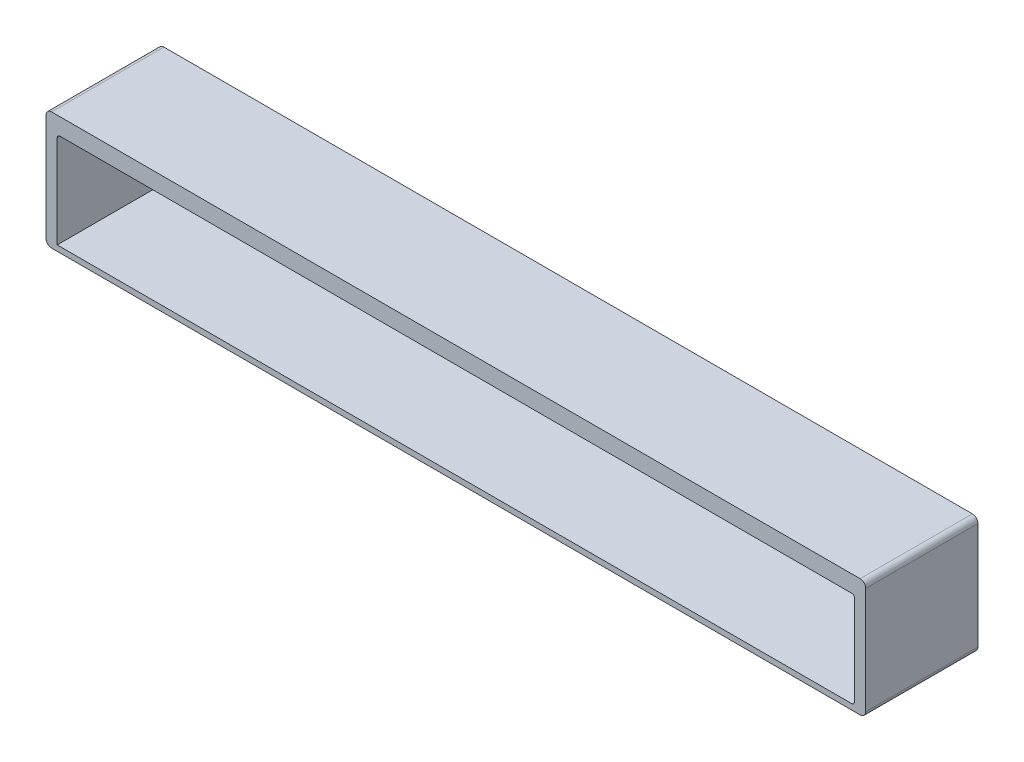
from build123d import *

# Parameters (mm, degrees)
SKIZZE17_W                      = 67
SKIZZE17_H                      = 1.5
LINEAR_AUSTRAGEN1_DEPTH         = 86.381151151
SKIZZE19_W                      = 1
SKIZZE19_H                      = 10.509377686
LINEAR_AUSTRAGEN2_DEPTH         = 67
SKIZZE23_W                      = 87.381151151
SKIZZE23_H                      = 1.5
LINEAR_AUSTRAGEN3_DEPTH         = 2
SKIZZE24_W                      = 87.381151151
SKIZZE24_H                      = 1.5
LINEAR_AUSTRAGEN4_DEPTH         = 2
SKIZZE25_W                      = 2
SKIZZE25_H                      = 1
LINEAR_AUSTRAGEN5_DEPTH         = 9.009377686
SKIZZE27_W                      = 1
SKIZZE27_H                      = 87.381151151
LINEAR_AUSTRAGEN7_DEPTH         = 10.509377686
SKIZZE29_W                      = 1
SKIZZE29_H                      = 87.381151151
LINEAR_AUSTRAGEN8_DEPTH         = 10.509377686
LINEAR_AUSTRAGEN9_REACH         = 129.4
SKIZZE36_W                      = 73
SKIZZE36_H                      = 0.5
SKIZZE37_W                      = 87.381151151
SKIZZE37_H                      = 46.159833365
SCHNITT_LINEAR_AUSTRAGEN1_DEPTH = 125.920482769
VERRUNDUNG1_R                   = 0.5
VERRUNDUNG2_R                   = 0.25


with BuildPart() as part:
    # Skizze17 → Linear austragen1 (new body)
    with BuildSketch(Plane.XY.offset(-12.618848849)):
        with Locations((-54.709965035, -6.857692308)):
            Rectangle(SKIZZE17_W, SKIZZE17_H)
    extrude(amount=-LINEAR_AUSTRAGEN1_DEPTH)

    # Skizze19 → Linear austragen2 (add)
    with BuildSketch(Plane(origin=(-21.209965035, 0, 0), x_dir=(0, 0, -1), z_dir=(1, 0, 0))):
        with Locations((99.5, -11.362381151)):
            Rectangle(SKIZZE19_W, SKIZZE19_H)
    extrude(amount=-LINEAR_AUSTRAGEN2_DEPTH)

    # Skizze23 → Linear austragen3 (add)
    with BuildSketch(Plane.ZY.offset(90.209965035)):
        with Locations((-56.309424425, -6.857692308)):
            Rectangle(SKIZZE23_W, SKIZZE23_H)
    extrude(amount=-LINEAR_AUSTRAGEN3_DEPTH)

    # Skizze24 → Linear austragen4 (add)
    with BuildSketch(Plane(origin=(-19.209965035, 0, 0), x_dir=(0, 0, -1), z_dir=(1, 0, 0))):
        with Locations((56.309424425, -6.857692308)):
            Rectangle(SKIZZE24_W, SKIZZE24_H)
    extrude(amount=-LINEAR_AUSTRAGEN4_DEPTH)

    # Skizze25 → Linear austragen5 (add)
    with BuildSketch(Plane.XZ.offset(16.617069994)):
        with Locations((-20.209965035, -99.5)):
            Rectangle(SKIZZE25_W, SKIZZE25_H)
    extrude(amount=-LINEAR_AUSTRAGEN5_DEPTH)

    # Skizze27 → Linear austragen7 (add)
    with BuildSketch(Plane(origin=(0, -6.107692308, 0), x_dir=(1, 0, 0), z_dir=(0, 1, 0))):
        with Locations((-90.709965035, 56.309424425)):
            Rectangle(SKIZZE27_W, SKIZZE27_H)
    extrude(amount=-LINEAR_AUSTRAGEN7_DEPTH)

    # Skizze29 → Linear austragen8 (add)
    with BuildSketch(Plane(origin=(0, -6.107692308, 0), x_dir=(1, 0, 0), z_dir=(0, 1, 0))):
        with Locations((-18.709965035, 56.309424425)):
            Rectangle(SKIZZE29_W, SKIZZE29_H)
    extrude(amount=-LINEAR_AUSTRAGEN8_DEPTH)

    # Linear austragen9: up to this face of the body (flat: up to its plane)
    linear_austragen9_end = Plane(part.part.faces().sort_by_distance((-53.880179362, -11.344342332, -100))[0])
    # Skizze36 → Linear austragen9 (add, up to the picked face)
    with BuildSketch(Plane.XY.offset(-12.618848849), mode=Mode.PRIVATE) as linear_austragen9_sk1:
        with Locations((-54.709965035, -16.367069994)):
            Rectangle(SKIZZE36_W, SKIZZE36_H)
    linear_austragen9_tool1 = split(extrude(linear_austragen9_sk1.sketch, amount=-LINEAR_AUSTRAGEN9_REACH, mode=Mode.PRIVATE), bisect_by=linear_austragen9_end, keep=Keep.BOTH, mode=Mode.PRIVATE)
    add(linear_austragen9_tool1.solids().sort_by(Axis((-54.709965, -16.36707, -12.618849), (0, 0, -1)))[0])

    # Skizze37 → Schnitt-Linear austragen1 (cut, through all)
    with BuildSketch(Plane.ZY.offset(91.209965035)):
        with Locations((-66.309424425, -17.591014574)):
            Rectangle(SKIZZE37_W, SKIZZE37_H)
    extrude(amount=-SCHNITT_LINEAR_AUSTRAGEN1_DEPTH, mode=Mode.SUBTRACT)

    # Verrundung1
    verrundung1_edges = [part.edges().sort_by_distance(p)[0] for p in [
        (-91.209965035, -6.107692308, -17.618848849),
        (-91.209965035, -16.617069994, -17.618848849),
        (-18.209965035, -6.107692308, -17.618848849),
        (-18.209965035, -16.617069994, -17.618848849),
    ]]
    fillet(verrundung1_edges, radius=VERRUNDUNG1_R)

    # Verrundung2
    verrundung2_edges = [part.edges().sort_by_distance(p)[0] for p in [
        (-90.209965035, -7.607692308, -17.618848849),
        (-19.209965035, -16.117069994, -17.618848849),
        (-19.209965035, -7.607692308, -17.618848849),
    ]]
    fillet(verrundung2_edges, radius=VERRUNDUNG2_R)


solid = part.part
